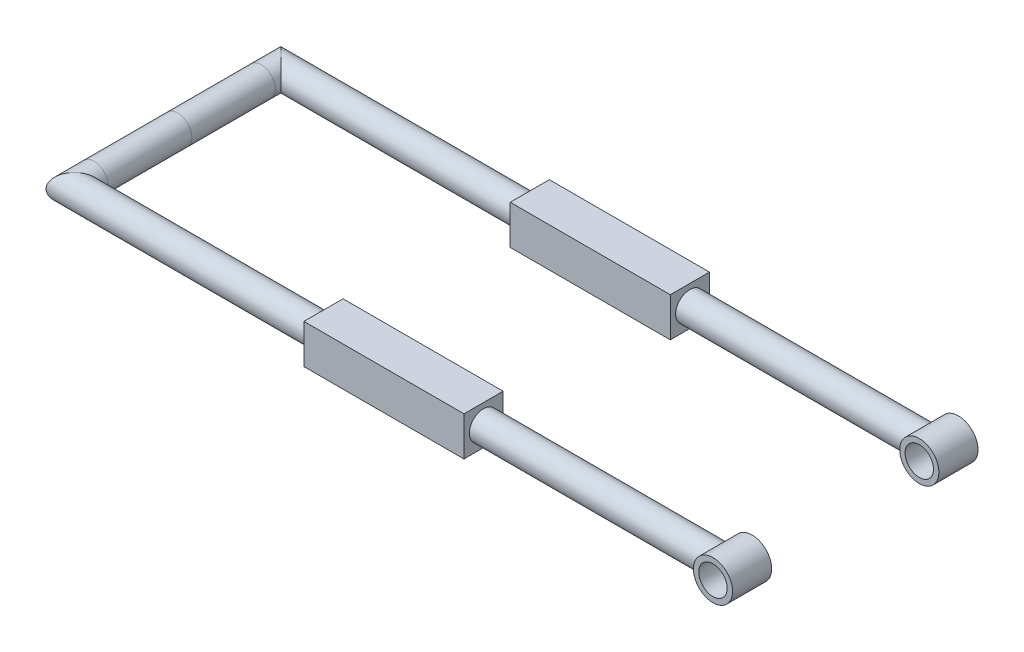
ISO-10303-21;
HEADER;
FILE_DESCRIPTION(('STEP AP214'),'2;1');
FILE_NAME('part.step','',(''),(''),'','','');
FILE_SCHEMA(('AUTOMOTIVE_DESIGN { 1 0 10303 214 1 1 1 1 }'));
ENDSEC;
DATA;
#1=APPLICATION_CONTEXT('core data for automotive mechanical design processes');
#2=APPLICATION_PROTOCOL_DEFINITION('international standard','automotive_design',2000,#1);
#3=PRODUCT_CONTEXT('',#1,'mechanical');
#4=PRODUCT('Part','Part','',(#3));
#5=PRODUCT_RELATED_PRODUCT_CATEGORY('part','',(#4));
#6=PRODUCT_DEFINITION_FORMATION('','',#4);
#7=PRODUCT_DEFINITION_CONTEXT('part definition',#1,'design');
#8=PRODUCT_DEFINITION('design','',#6,#7);
#9=PRODUCT_DEFINITION_SHAPE('','',#8);
#10=(LENGTH_UNIT() NAMED_UNIT(*) SI_UNIT(.MILLI.,.METRE.));
#11=(NAMED_UNIT(*) PLANE_ANGLE_UNIT() SI_UNIT($,.RADIAN.));
#12=(NAMED_UNIT(*) SI_UNIT($,.STERADIAN.) SOLID_ANGLE_UNIT());
#13=UNCERTAINTY_MEASURE_WITH_UNIT(LENGTH_MEASURE(1.E-05),#10,'distance_accuracy_value','');
#14=(GEOMETRIC_REPRESENTATION_CONTEXT(3) GLOBAL_UNCERTAINTY_ASSIGNED_CONTEXT((#13)) GLOBAL_UNIT_ASSIGNED_CONTEXT((#10,
#11,#12)) REPRESENTATION_CONTEXT('',''));
#15=CARTESIAN_POINT('',(0.,0.,0.));
#16=DIRECTION('',(0.,0.,1.));
#17=DIRECTION('',(1.,0.,0.));
#18=AXIS2_PLACEMENT_3D('',#15,#16,#17);
#19=CARTESIAN_POINT('',(939.8,0.,-175.26));
#20=DIRECTION('',(0.,0.,1.));
#21=DIRECTION('',(1.,0.,0.));
#22=AXIS2_PLACEMENT_3D('',#19,#20,#21);
#23=CYLINDRICAL_SURFACE('',#22,27.9399999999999);
#24=CARTESIAN_POINT('',(911.86,0.,-167.64));
#25=CARTESIAN_POINT('',(911.860004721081,0.499914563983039,-167.639995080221));
#26=CARTESIAN_POINT('',(911.87345068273,0.999977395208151,-167.621517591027));
#27=CARTESIAN_POINT('',(911.926931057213,1.99618720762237,-167.547886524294));
#28=CARTESIAN_POINT('',(911.966982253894,2.49233151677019,-167.492709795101));
#29=CARTESIAN_POINT('',(912.072839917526,3.47768027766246,-167.346401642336));
#30=CARTESIAN_POINT('',(912.13870558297,3.96686608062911,-167.255187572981));
#31=CARTESIAN_POINT('',(912.294650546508,4.93345998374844,-167.038233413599));
#32=CARTESIAN_POINT('',(912.384726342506,5.41086977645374,-166.912498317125));
#33=CARTESIAN_POINT('',(912.586522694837,6.34812576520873,-166.629116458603));
#34=CARTESIAN_POINT('',(912.698110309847,6.80806006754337,-166.471665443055));
#35=CARTESIAN_POINT('',(912.941040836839,7.71093407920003,-166.126316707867));
#36=CARTESIAN_POINT('',(913.072384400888,8.1538732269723,-165.938417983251));
#37=CARTESIAN_POINT('',(913.35232108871,9.02059776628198,-165.53427328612));
#38=CARTESIAN_POINT('',(913.500904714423,9.44439352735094,-165.318042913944));
#39=CARTESIAN_POINT('',(913.81286539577,10.2717055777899,-164.859050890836));
#40=CARTESIAN_POINT('',(913.976244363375,10.675219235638,-164.616285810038));
#41=CARTESIAN_POINT('',(914.33060346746,11.4965747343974,-164.082824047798));
#42=CARTESIAN_POINT('',(914.522742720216,11.9123887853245,-163.789776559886));
#43=CARTESIAN_POINT('',(914.918141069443,12.7176226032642,-163.176252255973));
#44=CARTESIAN_POINT('',(915.121400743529,13.1070409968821,-162.855774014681));
#45=CARTESIAN_POINT('',(915.535886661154,13.8593322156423,-162.188572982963));
#46=CARTESIAN_POINT('',(915.747124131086,14.222165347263,-161.841812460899));
#47=CARTESIAN_POINT('',(916.173702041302,14.9200854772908,-161.123773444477));
#48=CARTESIAN_POINT('',(916.389042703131,15.2551709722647,-160.752493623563));
#49=CARTESIAN_POINT('',(916.861261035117,15.9583752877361,-159.913133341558));
#50=CARTESIAN_POINT('',(917.118213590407,16.3205725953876,-159.44011175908));
#51=CARTESIAN_POINT('',(917.625648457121,17.0036121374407,-158.461623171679));
#52=CARTESIAN_POINT('',(917.876128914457,17.3244426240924,-157.956147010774));
#53=CARTESIAN_POINT('',(918.362336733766,17.9225677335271,-156.913975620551));
#54=CARTESIAN_POINT('',(918.598080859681,18.1999123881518,-156.377317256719));
#55=CARTESIAN_POINT('',(918.933696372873,18.5814355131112,-155.549513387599));
#56=CARTESIAN_POINT('',(919.042549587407,18.70284160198,-155.269830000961));
#57=CARTESIAN_POINT('',(919.253021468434,18.9338233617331,-154.7028491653));
#58=CARTESIAN_POINT('',(919.354638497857,19.043396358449,-154.415550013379));
#59=CARTESIAN_POINT('',(919.58237431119,19.2854206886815,-153.734536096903));
#60=CARTESIAN_POINT('',(919.705054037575,19.4129577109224,-153.337897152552));
#61=CARTESIAN_POINT('',(919.931353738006,19.6445088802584,-152.532592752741));
#62=CARTESIAN_POINT('',(920.034979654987,19.7485303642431,-152.123931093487));
#63=CARTESIAN_POINT('',(920.219556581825,19.9315513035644,-151.29677045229));
#64=CARTESIAN_POINT('',(920.300548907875,20.0105963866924,-150.878290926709));
#65=CARTESIAN_POINT('',(920.436940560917,20.1426061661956,-150.033066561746));
#66=CARTESIAN_POINT('',(920.492339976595,20.1955709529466,-149.606321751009));
#67=CARTESIAN_POINT('',(920.575411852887,20.2746681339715,-148.74438679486));
#68=CARTESIAN_POINT('',(920.60287437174,20.3005973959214,-148.309157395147));
#69=CARTESIAN_POINT('',(920.628016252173,20.3243437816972,-147.437076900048));
#70=CARTESIAN_POINT('',(920.625696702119,20.3221619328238,-147.000225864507));
#71=CARTESIAN_POINT('',(920.591379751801,20.2897277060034,-146.128476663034));
#72=CARTESIAN_POINT('',(920.559363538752,20.2594575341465,-145.693579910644));
#73=CARTESIAN_POINT('',(920.46716098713,20.1714884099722,-144.82959970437));
#74=CARTESIAN_POINT('',(920.406971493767,20.1137863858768,-144.40051690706));
#75=CARTESIAN_POINT('',(920.252654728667,19.9639109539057,-143.502255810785));
#76=CARTESIAN_POINT('',(920.15541786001,19.8685335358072,-143.034149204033));
#77=CARTESIAN_POINT('',(919.933829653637,19.6469677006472,-142.111917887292));
#78=CARTESIAN_POINT('',(919.809474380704,19.520774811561,-141.657795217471));
#79=CARTESIAN_POINT('',(919.538386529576,19.2392522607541,-140.764598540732));
#80=CARTESIAN_POINT('',(919.39161155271,19.0838672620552,-140.325555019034));
#81=CARTESIAN_POINT('',(919.080709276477,18.7458618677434,-139.464488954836));
#82=CARTESIAN_POINT('',(918.916580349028,18.5632389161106,-139.042468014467));
#83=CARTESIAN_POINT('',(918.517965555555,18.1063184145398,-138.076775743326));
#84=CARTESIAN_POINT('',(918.278398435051,17.8218583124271,-137.539992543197));
#85=CARTESIAN_POINT('',(917.785552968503,17.2093687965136,-136.498485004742));
#86=CARTESIAN_POINT('',(917.532270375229,16.8813258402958,-135.993770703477));
#87=CARTESIAN_POINT('',(917.019798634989,16.1831311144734,-135.016771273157));
#88=CARTESIAN_POINT('',(916.760604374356,15.8129416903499,-134.544515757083));
#89=CARTESIAN_POINT('',(916.243614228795,15.0319534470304,-133.63415313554));
#90=CARTESIAN_POINT('',(915.985818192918,14.6211591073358,-133.196042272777));
#91=CARTESIAN_POINT('',(915.474788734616,13.7544162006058,-132.350377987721));
#92=CARTESIAN_POINT('',(915.221654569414,13.2979612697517,-131.94328230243));
#93=CARTESIAN_POINT('',(914.729670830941,12.3454298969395,-131.168538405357));
#94=CARTESIAN_POINT('',(914.49082275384,11.8493493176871,-130.800894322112));
#95=CARTESIAN_POINT('',(914.033993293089,10.820012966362,-130.109154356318));
#96=CARTESIAN_POINT('',(913.815972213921,10.2868314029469,-129.784975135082));
#97=CARTESIAN_POINT('',(913.508857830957,9.46075321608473,-129.334033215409));
#98=CARTESIAN_POINT('',(913.409814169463,9.18103666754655,-129.189618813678));
#99=CARTESIAN_POINT('',(913.219026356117,8.61308213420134,-128.913017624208));
#100=CARTESIAN_POINT('',(913.127284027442,8.32484204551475,-128.780833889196));
#101=CARTESIAN_POINT('',(912.909141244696,7.59809282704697,-128.468075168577));
#102=CARTESIAN_POINT('',(912.787607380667,7.15473247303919,-128.295263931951));
#103=CARTESIAN_POINT('',(912.564634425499,6.25254655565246,-127.979980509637));
#104=CARTESIAN_POINT('',(912.463190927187,5.7937244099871,-127.837501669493));
#105=CARTESIAN_POINT('',(912.282430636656,4.8632717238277,-127.584670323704));
#106=CARTESIAN_POINT('',(912.203102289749,4.39164801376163,-127.474301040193));
#107=CARTESIAN_POINT('',(912.068200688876,3.43840217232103,-127.287134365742));
#108=CARTESIAN_POINT('',(912.012628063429,2.95677977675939,-127.210337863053));
#109=CARTESIAN_POINT('',(911.926336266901,1.98523511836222,-127.091267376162));
#110=CARTESIAN_POINT('',(911.895709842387,1.49528873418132,-127.049122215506));
#111=CARTESIAN_POINT('',(911.860378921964,0.51268982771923,-127.000514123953));
#112=CARTESIAN_POINT('',(911.855674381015,0.0200373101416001,-126.994051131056));
#113=CARTESIAN_POINT('',(911.872299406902,-0.964011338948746,-127.01691352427));
#114=CARTESIAN_POINT('',(911.893630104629,-1.45540741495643,-127.046240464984));
#115=CARTESIAN_POINT('',(911.961821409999,-2.43300024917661,-127.140207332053));
#116=CARTESIAN_POINT('',(912.008681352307,-2.91919714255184,-127.204846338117));
#117=CARTESIAN_POINT('',(912.123505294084,-3.85552230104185,-127.363798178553));
#118=CARTESIAN_POINT('',(912.190128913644,-4.30613751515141,-127.456230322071));
#119=CARTESIAN_POINT('',(912.343822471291,-5.19674046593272,-127.67041864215));
#120=CARTESIAN_POINT('',(912.430891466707,-5.63672869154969,-127.792173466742));
#121=CARTESIAN_POINT('',(912.623877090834,-6.50378723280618,-128.063583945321));
#122=CARTESIAN_POINT('',(912.729795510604,-6.93085631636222,-128.213242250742));
#123=CARTESIAN_POINT('',(912.958650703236,-7.77012216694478,-128.538885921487));
#124=CARTESIAN_POINT('',(913.081588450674,-8.18231808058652,-128.714872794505));
#125=CARTESIAN_POINT('',(913.353405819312,-9.0240126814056,-129.107289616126));
#126=CARTESIAN_POINT('',(913.503594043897,-9.45208592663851,-129.325868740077));
#127=CARTESIAN_POINT('',(913.819031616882,-10.2874817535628,-129.790068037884));
#128=CARTESIAN_POINT('',(913.984281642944,-10.6948034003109,-130.035689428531));
#129=CARTESIAN_POINT('',(914.327258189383,-11.4878081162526,-130.552271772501));
#130=CARTESIAN_POINT('',(914.504990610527,-11.8734807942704,-130.823244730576));
#131=CARTESIAN_POINT('',(914.870173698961,-12.6222388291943,-131.388845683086));
#132=CARTESIAN_POINT('',(915.057625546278,-12.9853214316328,-131.683476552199));
#133=CARTESIAN_POINT('',(915.474420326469,-13.7525843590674,-132.350947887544));
#134=CARTESIAN_POINT('',(915.705156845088,-14.1521437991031,-132.728239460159));
#135=CARTESIAN_POINT('',(916.171726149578,-14.9180901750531,-133.512269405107));
#136=CARTESIAN_POINT('',(916.407559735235,-15.284471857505,-133.919012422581));
#137=CARTESIAN_POINT('',(916.879521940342,-15.9835308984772,-134.760987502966));
#138=CARTESIAN_POINT('',(917.115650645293,-16.3161812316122,-135.196241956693));
#139=CARTESIAN_POINT('',(917.582545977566,-16.9464472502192,-136.094086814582));
#140=CARTESIAN_POINT('',(917.813313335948,-17.2440677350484,-136.556673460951));
#141=CARTESIAN_POINT('',(918.236255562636,-17.7693040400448,-137.451365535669));
#142=CARTESIAN_POINT('',(918.429732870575,-18.0010341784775,-137.880440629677));
#143=CARTESIAN_POINT('',(918.803021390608,-18.4350864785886,-138.75903961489));
#144=CARTESIAN_POINT('',(918.982832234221,-18.6374078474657,-139.208564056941));
#145=CARTESIAN_POINT('',(919.323083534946,-19.0106068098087,-140.126646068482));
#146=CARTESIAN_POINT('',(919.483556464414,-19.1815373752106,-140.595169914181));
#147=CARTESIAN_POINT('',(919.779509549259,-19.4902373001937,-141.550693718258));
#148=CARTESIAN_POINT('',(919.914997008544,-19.6280163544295,-142.037688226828));
#149=CARTESIAN_POINT('',(920.128986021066,-19.8421907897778,-142.921177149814));
#150=CARTESIAN_POINT('',(920.213476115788,-19.9254156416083,-143.314571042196));
#151=CARTESIAN_POINT('',(920.360467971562,-20.0688509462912,-144.109596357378));
#152=CARTESIAN_POINT('',(920.422972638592,-20.129064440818,-144.511226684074));
#153=CARTESIAN_POINT('',(920.523568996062,-20.2254217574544,-145.319922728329));
#154=CARTESIAN_POINT('',(920.561690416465,-20.2615948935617,-145.726981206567));
#155=CARTESIAN_POINT('',(920.612064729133,-20.3093073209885,-146.544159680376));
#156=CARTESIAN_POINT('',(920.62431746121,-20.3208464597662,-146.954279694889));
#157=CARTESIAN_POINT('',(920.622419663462,-20.3190554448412,-147.775015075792));
#158=CARTESIAN_POINT('',(920.608229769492,-20.3056882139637,-148.185630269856));
#159=CARTESIAN_POINT('',(920.553986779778,-20.2542822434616,-149.003564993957));
#160=CARTESIAN_POINT('',(920.513933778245,-20.2162435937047,-149.410884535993));
#161=CARTESIAN_POINT('',(920.409546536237,-20.1161407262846,-150.219944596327));
#162=CARTESIAN_POINT('',(920.345179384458,-20.0540439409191,-150.621676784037));
#163=CARTESIAN_POINT('',(920.194595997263,-19.9068526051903,-151.41672488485));
#164=CARTESIAN_POINT('',(920.108376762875,-19.8217548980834,-151.810039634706));
#165=CARTESIAN_POINT('',(919.887755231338,-19.6004436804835,-152.704912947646));
#166=CARTESIAN_POINT('',(919.746676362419,-19.4565558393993,-153.202936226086));
#167=CARTESIAN_POINT('',(919.438812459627,-19.1341384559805,-154.179430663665));
#168=CARTESIAN_POINT('',(919.272018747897,-18.9555972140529,-154.657895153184));
#169=CARTESIAN_POINT('',(918.918881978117,-18.5658752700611,-155.594558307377));
#170=CARTESIAN_POINT('',(918.732514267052,-18.3546532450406,-156.052730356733));
#171=CARTESIAN_POINT('',(918.346154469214,-17.9015295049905,-156.94752052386));
#172=CARTESIAN_POINT('',(918.146163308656,-17.6596298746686,-157.384140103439));
#173=CARTESIAN_POINT('',(917.731599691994,-17.138940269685,-158.247985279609));
#174=CARTESIAN_POINT('',(917.516771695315,-16.8592770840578,-158.674560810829));
#175=CARTESIAN_POINT('',(917.08286263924,-16.2698866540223,-159.504090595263));
#176=CARTESIAN_POINT('',(916.863781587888,-15.9601594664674,-159.907044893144));
#177=CARTESIAN_POINT('',(916.42561817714,-15.3112764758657,-160.688819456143));
#178=CARTESIAN_POINT('',(916.206535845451,-14.9721101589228,-161.067631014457));
#179=CARTESIAN_POINT('',(915.772424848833,-14.2650411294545,-161.799989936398));
#180=CARTESIAN_POINT('',(915.557396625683,-13.8971353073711,-162.153534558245));
#181=CARTESIAN_POINT('',(915.089191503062,-13.0499768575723,-162.908088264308));
#182=CARTESIAN_POINT('',(914.837899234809,-12.5639191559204,-163.302677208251));
#183=CARTESIAN_POINT('',(914.353480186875,-11.5513326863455,-164.049159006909));
#184=CARTESIAN_POINT('',(914.120357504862,-11.0247948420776,-164.401042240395));
#185=CARTESIAN_POINT('',(913.679008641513,-9.93394397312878,-165.057643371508));
#186=CARTESIAN_POINT('',(913.470757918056,-9.36966905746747,-165.362407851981));
#187=CARTESIAN_POINT('',(913.085284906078,-8.20625218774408,-165.920416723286));
#188=CARTESIAN_POINT('',(912.908046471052,-7.60712859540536,-166.173687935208));
#189=CARTESIAN_POINT('',(912.635689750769,-6.55363076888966,-166.559841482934));
#190=CARTESIAN_POINT('',(912.531554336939,-6.10657201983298,-166.706474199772));
#191=CARTESIAN_POINT('',(912.344111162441,-5.19925008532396,-166.969252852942));
#192=CARTESIAN_POINT('',(912.260802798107,-4.7389872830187,-167.085399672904));
#193=CARTESIAN_POINT('',(912.116910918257,-3.80931657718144,-167.28539571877));
#194=CARTESIAN_POINT('',(912.056267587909,-3.33993623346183,-167.36932997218));
#195=CARTESIAN_POINT('',(911.958713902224,-2.39418248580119,-167.504107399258));
#196=CARTESIAN_POINT('',(911.921790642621,-1.91781302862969,-167.554968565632));
#197=CARTESIAN_POINT('',(911.884767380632,-1.20038726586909,-167.605934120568));
#198=CARTESIAN_POINT('',(911.875486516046,-0.960614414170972,-167.61870165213));
#199=CARTESIAN_POINT('',(911.86310121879,-0.480572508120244,-167.635736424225));
#200=CARTESIAN_POINT('',(911.859997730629,-0.240303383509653,-167.640002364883));
#201=CARTESIAN_POINT('',(911.86,0.,-167.64));
#202=B_SPLINE_CURVE_WITH_KNOTS('',3,(#24,#25,#26,#27,#28,#29,#30,#31,#32,#33,#34,#35,#36,#37,
#38,#39,#40,#41,#42,#43,#44,#45,#46,#47,#48,#49,#50,#51,#52,#53,#54,#55,#56,#57,#58,#59,#60,#61,
#62,#63,#64,#65,#66,#67,#68,#69,#70,#71,#72,#73,#74,#75,#76,#77,#78,#79,#80,#81,#82,#83,#84,#85,
#86,#87,#88,#89,#90,#91,#92,#93,#94,#95,#96,#97,#98,#99,#100,#101,#102,#103,#104,#105,#106,#107,
#108,#109,#110,#111,#112,#113,#114,#115,#116,#117,#118,#119,#120,#121,#122,#123,#124,#125,#126,
#127,#128,#129,#130,#131,#132,#133,#134,#135,#136,#137,#138,#139,#140,#141,#142,#143,#144,#145,
#146,#147,#148,#149,#150,#151,#152,#153,#154,#155,#156,#157,#158,#159,#160,#161,#162,#163,#164,
#165,#166,#167,#168,#169,#170,#171,#172,#173,#174,#175,#176,#177,#178,#179,#180,#181,#182,#183,
#184,#185,#186,#187,#188,#189,#190,#191,#192,#193,#194,#195,#196,#197,#198,#199,#200,#201),
.UNSPECIFIED.,.T.,.F.,(4,2,2,2,2,2,2,2,2,2,2,2,2,2,2,2,2,2,2,2,2,2,2,2,2,2,2,2,2,2,2,2,2,2,2,2,
2,2,2,2,2,2,2,2,2,2,2,2,2,2,2,2,2,2,2,2,2,2,2,2,2,2,2,2,2,2,2,2,2,2,2,2,2,2,2,2,2,2,2,2,2,2,2,2,
2,2,2,2,4),(0.,1.49948350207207,2.99991384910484,4.50380535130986,6.00747942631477,
7.50214270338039,8.99685532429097,10.490748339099,11.984834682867,13.6146338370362,
15.2445177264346,16.8767875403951,18.5091457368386,20.4533981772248,22.3982015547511,
24.3407506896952,25.311665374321,26.2827990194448,27.5846123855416,28.8860190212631,
30.1850342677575,31.4840450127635,32.792747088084,34.1014013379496,35.4108851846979,
36.7205157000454,38.1809335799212,39.6415635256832,41.1049907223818,42.5685553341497,
44.5249437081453,46.4819414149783,48.4407014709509,50.3992456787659,52.3826161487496,
54.3661939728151,56.3459124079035,57.3355881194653,58.325510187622,59.797282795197,
61.2687321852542,62.7394113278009,64.2101293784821,65.6862907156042,67.1624494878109,
68.6386723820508,70.1148568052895,71.5077256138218,72.9005302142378,74.2934672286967,
75.6864840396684,77.1957174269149,78.7050187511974,80.2150384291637,81.7252418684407,
83.5115243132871,85.2980891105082,87.086074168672,88.8738139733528,90.4464305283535,
92.0190894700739,93.5890696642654,95.1585901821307,96.3900480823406,97.6213431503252,
98.8511340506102,100.080932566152,101.312563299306,102.544189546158,103.777488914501,
105.01095763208,106.620273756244,108.230134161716,109.842047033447,111.453850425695,
113.112879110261,114.771904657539,116.431525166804,118.091325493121,120.112425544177,
122.133980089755,124.153523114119,126.172011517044,127.616204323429,129.060355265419,
130.500667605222,131.940195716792,132.660870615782,133.381655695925),.UNSPECIFIED.);
#203=CARTESIAN_POINT('',(911.86,0.,-167.64));
#204=VERTEX_POINT('',#203);
#205=EDGE_CURVE('E49',#204,#204,#202,.T.);
#206=ORIENTED_EDGE('',*,*,#205,.T.);
#207=EDGE_LOOP('',(#206));
#208=FACE_BOUND('',#207,.T.);
#209=CARTESIAN_POINT('',(939.8,0.,-175.26));
#210=DIRECTION('',(0.,0.,1.));
#211=DIRECTION('',(1.,0.,0.));
#212=AXIS2_PLACEMENT_3D('',#209,#210,#211);
#213=CIRCLE('',#212,27.9399999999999);
#214=CARTESIAN_POINT('',(967.74,0.,-175.26));
#215=VERTEX_POINT('',#214);
#216=EDGE_CURVE('E331',#215,#215,#213,.T.);
#217=ORIENTED_EDGE('',*,*,#216,.T.);
#218=EDGE_LOOP('',(#217));
#219=FACE_BOUND('',#218,.T.);
#220=CARTESIAN_POINT('',(939.8,0.,-119.38));
#221=DIRECTION('',(0.,0.,1.));
#222=DIRECTION('',(1.,0.,0.));
#223=AXIS2_PLACEMENT_3D('',#220,#221,#222);
#224=CIRCLE('',#223,27.9399999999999);
#225=CARTESIAN_POINT('',(967.74,0.,-119.38));
#226=VERTEX_POINT('',#225);
#227=EDGE_CURVE('E334',#226,#226,#224,.T.);
#228=ORIENTED_EDGE('',*,*,#227,.F.);
#229=EDGE_LOOP('',(#228));
#230=FACE_BOUND('',#229,.T.);
#231=ADVANCED_FACE('F39',(#208,#219,#230),#23,.T.);
#232=CARTESIAN_POINT('',(939.8,0.,-175.26));
#233=DIRECTION('',(0.,0.,1.));
#234=DIRECTION('',(1.,0.,0.));
#235=AXIS2_PLACEMENT_3D('',#232,#233,#234);
#236=CYLINDRICAL_SURFACE('',#235,20.32);
#237=CARTESIAN_POINT('',(939.8,0.,-175.26));
#238=DIRECTION('',(0.,0.,1.));
#239=DIRECTION('',(1.,0.,0.));
#240=AXIS2_PLACEMENT_3D('',#237,#238,#239);
#241=CIRCLE('',#240,20.32);
#242=CARTESIAN_POINT('',(960.12,0.,-175.26));
#243=VERTEX_POINT('',#242);
#244=EDGE_CURVE('E345',#243,#243,#241,.T.);
#245=ORIENTED_EDGE('',*,*,#244,.F.);
#246=EDGE_LOOP('',(#245));
#247=FACE_BOUND('',#246,.T.);
#248=CARTESIAN_POINT('',(939.8,0.,-119.38));
#249=DIRECTION('',(0.,0.,1.));
#250=DIRECTION('',(1.,0.,0.));
#251=AXIS2_PLACEMENT_3D('',#248,#249,#250);
#252=CIRCLE('',#251,20.32);
#253=CARTESIAN_POINT('',(960.12,0.,-119.38));
#254=VERTEX_POINT('',#253);
#255=EDGE_CURVE('E43',#254,#254,#252,.F.);
#256=ORIENTED_EDGE('',*,*,#255,.F.);
#257=EDGE_LOOP('',(#256));
#258=FACE_BOUND('',#257,.T.);
#259=ADVANCED_FACE('F301',(#247,#258),#236,.F.);
#260=CARTESIAN_POINT('',(-22.452,0.,147.32));
#261=DIRECTION('',(1.,0.,0.));
#262=DIRECTION('',(0.,0.,-1.));
#263=AXIS2_PLACEMENT_3D('',#260,#261,#262);
#264=CYLINDRICAL_SURFACE('',#263,20.32);
#265=CARTESIAN_POINT('',(0.,0.,147.32));
#266=DIRECTION('',(0.707106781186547,0.,0.707106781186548));
#267=DIRECTION('',(-0.707106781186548,0.,0.707106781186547));
#268=AXIS2_PLACEMENT_3D('',#265,#266,#267);
#269=ELLIPSE('',#268,28.7368195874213,20.32);
#270=CARTESIAN_POINT('',(-20.32,0.,167.64));
#271=VERTEX_POINT('',#270);
#272=EDGE_CURVE('E208',#271,#271,#269,.F.);
#273=ORIENTED_EDGE('',*,*,#272,.F.);
#274=EDGE_LOOP('',(#273));
#275=FACE_BOUND('',#274,.T.);
#276=CARTESIAN_POINT('',(355.6,0.,147.32));
#277=DIRECTION('',(1.,0.,0.));
#278=DIRECTION('',(0.,0.,-1.));
#279=AXIS2_PLACEMENT_3D('',#276,#277,#278);
#280=CIRCLE('',#279,20.32);
#281=CARTESIAN_POINT('',(355.6,0.,127.));
#282=VERTEX_POINT('',#281);
#283=EDGE_CURVE('E196',#282,#282,#280,.T.);
#284=ORIENTED_EDGE('',*,*,#283,.F.);
#285=EDGE_LOOP('',(#284));
#286=FACE_BOUND('',#285,.T.);
#287=ADVANCED_FACE('F41',(#275,#286),#264,.T.);
#288=CARTESIAN_POINT('',(0.,0.,-169.772));
#289=DIRECTION('',(0.,0.,1.));
#290=DIRECTION('',(1.,0.,0.));
#291=AXIS2_PLACEMENT_3D('',#288,#289,#290);
#292=CYLINDRICAL_SURFACE('',#291,20.32);
#293=CARTESIAN_POINT('',(0.,0.,-147.32));
#294=DIRECTION('',(-0.707106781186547,0.,0.707106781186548));
#295=DIRECTION('',(-0.707106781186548,0.,-0.707106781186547));
#296=AXIS2_PLACEMENT_3D('',#293,#294,#295);
#297=ELLIPSE('',#296,28.7368195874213,20.32);
#298=CARTESIAN_POINT('',(-20.3200000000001,0.,-167.64));
#299=VERTEX_POINT('',#298);
#300=EDGE_CURVE('E197',#299,#299,#297,.F.);
#301=ORIENTED_EDGE('',*,*,#300,.F.);
#302=EDGE_LOOP('',(#301));
#303=FACE_BOUND('',#302,.T.);
#304=CARTESIAN_POINT('',(0.,0.,-119.38));
#305=DIRECTION('',(0.,0.,1.));
#306=DIRECTION('',(1.,0.,0.));
#307=AXIS2_PLACEMENT_3D('',#304,#305,#306);
#308=CIRCLE('',#307,20.32);
#309=CARTESIAN_POINT('',(20.32,0.,-119.38));
#310=VERTEX_POINT('',#309);
#311=EDGE_CURVE('E203',#310,#310,#308,.T.);
#312=ORIENTED_EDGE('',*,*,#311,.F.);
#313=EDGE_LOOP('',(#312));
#314=FACE_BOUND('',#313,.T.);
#315=ADVANCED_FACE('F302',(#303,#314),#292,.T.);
#316=CARTESIAN_POINT('',(0.,0.,-119.38));
#317=DIRECTION('',(0.,0.,1.));
#318=DIRECTION('',(1.,0.,0.));
#319=AXIS2_PLACEMENT_3D('',#316,#317,#318);
#320=CYLINDRICAL_SURFACE('',#319,20.32);
#321=CARTESIAN_POINT('',(0.,0.,0.));
#322=DIRECTION('',(0.,0.,1.));
#323=DIRECTION('',(1.,0.,0.));
#324=AXIS2_PLACEMENT_3D('',#321,#322,#323);
#325=CIRCLE('',#324,20.32);
#326=CARTESIAN_POINT('',(20.32,0.,0.));
#327=VERTEX_POINT('',#326);
#328=EDGE_CURVE('E207',#327,#327,#325,.T.);
#329=ORIENTED_EDGE('',*,*,#328,.F.);
#330=EDGE_LOOP('',(#329));
#331=FACE_BOUND('',#330,.T.);
#332=ORIENTED_EDGE('',*,*,#311,.T.);
#333=EDGE_LOOP('',(#332));
#334=FACE_BOUND('',#333,.T.);
#335=ADVANCED_FACE('F305',(#331,#334),#320,.T.);
#336=CARTESIAN_POINT('',(0.,0.,0.));
#337=DIRECTION('',(0.,0.,1.));
#338=DIRECTION('',(1.,0.,0.));
#339=AXIS2_PLACEMENT_3D('',#336,#337,#338);
#340=CYLINDRICAL_SURFACE('',#339,20.32);
#341=CARTESIAN_POINT('',(0.,0.,119.38));
#342=DIRECTION('',(0.,0.,1.));
#343=DIRECTION('',(1.,0.,0.));
#344=AXIS2_PLACEMENT_3D('',#341,#342,#343);
#345=CIRCLE('',#344,20.32);
#346=CARTESIAN_POINT('',(20.32,0.,119.38));
#347=VERTEX_POINT('',#346);
#348=EDGE_CURVE('E202',#347,#347,#345,.T.);
#349=ORIENTED_EDGE('',*,*,#348,.F.);
#350=EDGE_LOOP('',(#349));
#351=FACE_BOUND('',#350,.T.);
#352=ORIENTED_EDGE('',*,*,#328,.T.);
#353=EDGE_LOOP('',(#352));
#354=FACE_BOUND('',#353,.T.);
#355=ADVANCED_FACE('F309',(#351,#354),#340,.T.);
#356=CARTESIAN_POINT('',(0.,0.,119.38));
#357=DIRECTION('',(0.,0.,1.));
#358=DIRECTION('',(1.,0.,0.));
#359=AXIS2_PLACEMENT_3D('',#356,#357,#358);
#360=CYLINDRICAL_SURFACE('',#359,20.32);
#361=ORIENTED_EDGE('',*,*,#348,.T.);
#362=EDGE_LOOP('',(#361));
#363=FACE_BOUND('',#362,.T.);
#364=ORIENTED_EDGE('',*,*,#272,.T.);
#365=EDGE_LOOP('',(#364));
#366=FACE_BOUND('',#365,.T.);
#367=ADVANCED_FACE('F299',(#363,#366),#360,.T.);
#368=CARTESIAN_POINT('',(355.6,0.,-147.32));
#369=DIRECTION('',(-1.,0.,0.));
#370=DIRECTION('',(0.,0.,1.));
#371=AXIS2_PLACEMENT_3D('',#368,#369,#370);
#372=CYLINDRICAL_SURFACE('',#371,20.32);
#373=CARTESIAN_POINT('',(355.6,0.,-147.32));
#374=DIRECTION('',(-1.,0.,0.));
#375=DIRECTION('',(0.,0.,1.));
#376=AXIS2_PLACEMENT_3D('',#373,#374,#375);
#377=CIRCLE('',#376,20.32);
#378=CARTESIAN_POINT('',(355.6,0.,-127.));
#379=VERTEX_POINT('',#378);
#380=EDGE_CURVE('E192',#379,#379,#377,.T.);
#381=ORIENTED_EDGE('',*,*,#380,.T.);
#382=EDGE_LOOP('',(#381));
#383=FACE_BOUND('',#382,.T.);
#384=ORIENTED_EDGE('',*,*,#300,.T.);
#385=EDGE_LOOP('',(#384));
#386=FACE_BOUND('',#385,.T.);
#387=ADVANCED_FACE('F295',(#383,#386),#372,.T.);
#388=CARTESIAN_POINT('',(584.2,-27.94,-175.26));
#389=DIRECTION('',(-1.,0.,0.));
#390=DIRECTION('',(0.,0.,1.));
#391=AXIS2_PLACEMENT_3D('',#388,#389,#390);
#392=PLANE('',#391);
#393=CARTESIAN_POINT('',(584.2,0.,-147.32));
#394=DIRECTION('',(-1.,0.,0.));
#395=DIRECTION('',(0.,0.,1.));
#396=AXIS2_PLACEMENT_3D('',#393,#394,#395);
#397=CIRCLE('',#396,20.32);
#398=CARTESIAN_POINT('',(584.2,0.,-127.));
#399=VERTEX_POINT('',#398);
#400=EDGE_CURVE('E201',#399,#399,#397,.F.);
#401=ORIENTED_EDGE('',*,*,#400,.F.);
#402=EDGE_LOOP('',(#401));
#403=FACE_BOUND('',#402,.T.);
#404=DIRECTION('',(0.,1.,0.));
#405=VECTOR('',#404,1.);
#406=CARTESIAN_POINT('',(584.2,-27.94,-175.26));
#407=LINE('',#406,#405);
#408=CARTESIAN_POINT('',(584.2,-27.94,-175.26));
#409=VERTEX_POINT('',#408);
#410=CARTESIAN_POINT('',(584.2,27.94,-175.26));
#411=VERTEX_POINT('',#410);
#412=EDGE_CURVE('E180',#409,#411,#407,.T.);
#413=ORIENTED_EDGE('',*,*,#412,.T.);
#414=DIRECTION('',(0.,0.,1.));
#415=VECTOR('',#414,1.);
#416=CARTESIAN_POINT('',(584.2,27.94,-175.26));
#417=LINE('',#416,#415);
#418=CARTESIAN_POINT('',(584.2,27.94,-119.38));
#419=VERTEX_POINT('',#418);
#420=EDGE_CURVE('E154',#411,#419,#417,.T.);
#421=ORIENTED_EDGE('',*,*,#420,.T.);
#422=DIRECTION('',(0.,1.,0.));
#423=VECTOR('',#422,1.);
#424=CARTESIAN_POINT('',(584.2,-27.94,-119.38));
#425=LINE('',#424,#423);
#426=CARTESIAN_POINT('',(584.2,-27.94,-119.38));
#427=VERTEX_POINT('',#426);
#428=EDGE_CURVE('E189',#427,#419,#425,.T.);
#429=ORIENTED_EDGE('',*,*,#428,.F.);
#430=DIRECTION('',(0.,0.,1.));
#431=VECTOR('',#430,1.);
#432=CARTESIAN_POINT('',(584.2,-27.94,-175.26));
#433=LINE('',#432,#431);
#434=EDGE_CURVE('E170',#409,#427,#433,.T.);
#435=ORIENTED_EDGE('',*,*,#434,.F.);
#436=EDGE_LOOP('',(#413,#421,#429,#435));
#437=FACE_BOUND('',#436,.T.);
#438=ADVANCED_FACE('F291',(#403,#437),#392,.F.);
#439=CARTESIAN_POINT('',(584.2,-27.94,-119.38));
#440=DIRECTION('',(0.,0.,-1.));
#441=DIRECTION('',(-1.,0.,0.));
#442=AXIS2_PLACEMENT_3D('',#439,#440,#441);
#443=PLANE('',#442);
#444=ORIENTED_EDGE('',*,*,#428,.T.);
#445=DIRECTION('',(-1.,0.,0.));
#446=VECTOR('',#445,1.);
#447=CARTESIAN_POINT('',(584.2,27.94,-119.38));
#448=LINE('',#447,#446);
#449=CARTESIAN_POINT('',(355.6,27.94,-119.38));
#450=VERTEX_POINT('',#449);
#451=EDGE_CURVE('E158',#419,#450,#448,.T.);
#452=ORIENTED_EDGE('',*,*,#451,.T.);
#453=DIRECTION('',(0.,1.,0.));
#454=VECTOR('',#453,1.);
#455=CARTESIAN_POINT('',(355.6,-27.94,-119.38));
#456=LINE('',#455,#454);
#457=CARTESIAN_POINT('',(355.6,-27.94,-119.38));
#458=VERTEX_POINT('',#457);
#459=EDGE_CURVE('E186',#458,#450,#456,.T.);
#460=ORIENTED_EDGE('',*,*,#459,.F.);
#461=DIRECTION('',(-1.,0.,0.));
#462=VECTOR('',#461,1.);
#463=CARTESIAN_POINT('',(584.2,-27.94,-119.38));
#464=LINE('',#463,#462);
#465=EDGE_CURVE('E173',#427,#458,#464,.T.);
#466=ORIENTED_EDGE('',*,*,#465,.F.);
#467=EDGE_LOOP('',(#444,#452,#460,#466));
#468=FACE_BOUND('',#467,.T.);
#469=ADVANCED_FACE('F287',(#468),#443,.F.);
#470=CARTESIAN_POINT('',(355.6,-27.94,-147.32));
#471=DIRECTION('',(1.,0.,0.));
#472=DIRECTION('',(0.,0.,-1.));
#473=AXIS2_PLACEMENT_3D('',#470,#471,#472);
#474=PLANE('',#473);
#475=ORIENTED_EDGE('',*,*,#380,.F.);
#476=EDGE_LOOP('',(#475));
#477=FACE_BOUND('',#476,.T.);
#478=ORIENTED_EDGE('',*,*,#459,.T.);
#479=DIRECTION('',(0.,0.,1.));
#480=VECTOR('',#479,1.);
#481=CARTESIAN_POINT('',(355.6,27.94,-147.32));
#482=LINE('',#481,#480);
#483=CARTESIAN_POINT('',(355.6,27.94,-175.26));
#484=VERTEX_POINT('',#483);
#485=EDGE_CURVE('E162',#484,#450,#482,.T.);
#486=ORIENTED_EDGE('',*,*,#485,.F.);
#487=DIRECTION('',(0.,1.,0.));
#488=VECTOR('',#487,1.);
#489=CARTESIAN_POINT('',(355.6,-27.94,-175.26));
#490=LINE('',#489,#488);
#491=CARTESIAN_POINT('',(355.6,-27.94,-175.26));
#492=VERTEX_POINT('',#491);
#493=EDGE_CURVE('E183',#492,#484,#490,.T.);
#494=ORIENTED_EDGE('',*,*,#493,.F.);
#495=DIRECTION('',(0.,0.,1.));
#496=VECTOR('',#495,1.);
#497=CARTESIAN_POINT('',(355.6,-27.94,-147.32));
#498=LINE('',#497,#496);
#499=EDGE_CURVE('E62',#492,#458,#498,.T.);
#500=ORIENTED_EDGE('',*,*,#499,.T.);
#501=EDGE_LOOP('',(#478,#486,#494,#500));
#502=FACE_BOUND('',#501,.T.);
#503=ADVANCED_FACE('F283',(#477,#502),#474,.F.);
#504=CARTESIAN_POINT('',(355.6,-27.94,-175.26));
#505=DIRECTION('',(0.,0.,1.));
#506=DIRECTION('',(1.,0.,0.));
#507=AXIS2_PLACEMENT_3D('',#504,#505,#506);
#508=PLANE('',#507);
#509=ORIENTED_EDGE('',*,*,#493,.T.);
#510=DIRECTION('',(1.,0.,0.));
#511=VECTOR('',#510,1.);
#512=CARTESIAN_POINT('',(355.6,27.94,-175.26));
#513=LINE('',#512,#511);
#514=EDGE_CURVE('E166',#484,#411,#513,.T.);
#515=ORIENTED_EDGE('',*,*,#514,.T.);
#516=ORIENTED_EDGE('',*,*,#412,.F.);
#517=DIRECTION('',(1.,0.,0.));
#518=VECTOR('',#517,1.);
#519=CARTESIAN_POINT('',(355.6,-27.94,-175.26));
#520=LINE('',#519,#518);
#521=EDGE_CURVE('E57',#492,#409,#520,.T.);
#522=ORIENTED_EDGE('',*,*,#521,.F.);
#523=EDGE_LOOP('',(#509,#515,#516,#522));
#524=FACE_BOUND('',#523,.T.);
#525=ADVANCED_FACE('F280',(#524),#508,.F.);
#526=CARTESIAN_POINT('',(0.,-27.94,0.));
#527=DIRECTION('',(0.,-1.,0.));
#528=DIRECTION('',(0.,0.,-1.));
#529=AXIS2_PLACEMENT_3D('',#526,#527,#528);
#530=PLANE('',#529);
#531=ORIENTED_EDGE('',*,*,#434,.T.);
#532=ORIENTED_EDGE('',*,*,#465,.T.);
#533=ORIENTED_EDGE('',*,*,#499,.F.);
#534=ORIENTED_EDGE('',*,*,#521,.T.);
#535=EDGE_LOOP('',(#531,#532,#533,#534));
#536=FACE_BOUND('',#535,.T.);
#537=ADVANCED_FACE('F276',(#536),#530,.T.);
#538=CARTESIAN_POINT('',(0.,27.94,0.));
#539=DIRECTION('',(0.,-1.,0.));
#540=DIRECTION('',(0.,0.,-1.));
#541=AXIS2_PLACEMENT_3D('',#538,#539,#540);
#542=PLANE('',#541);
#543=ORIENTED_EDGE('',*,*,#420,.F.);
#544=ORIENTED_EDGE('',*,*,#514,.F.);
#545=ORIENTED_EDGE('',*,*,#485,.T.);
#546=ORIENTED_EDGE('',*,*,#451,.F.);
#547=EDGE_LOOP('',(#543,#544,#545,#546));
#548=FACE_BOUND('',#547,.T.);
#549=ADVANCED_FACE('F257',(#548),#542,.F.);
#550=CARTESIAN_POINT('',(355.6,-27.94,175.26));
#551=DIRECTION('',(0.,0.,1.));
#552=DIRECTION('',(1.,0.,0.));
#553=AXIS2_PLACEMENT_3D('',#550,#551,#552);
#554=PLANE('',#553);
#555=DIRECTION('',(0.,1.,0.));
#556=VECTOR('',#555,1.);
#557=CARTESIAN_POINT('',(584.2,-27.94,175.26));
#558=LINE('',#557,#556);
#559=CARTESIAN_POINT('',(584.2,-27.94,175.26));
#560=VERTEX_POINT('',#559);
#561=CARTESIAN_POINT('',(584.2,27.94,175.26));
#562=VERTEX_POINT('',#561);
#563=EDGE_CURVE('E119',#560,#562,#558,.T.);
#564=ORIENTED_EDGE('',*,*,#563,.T.);
#565=DIRECTION('',(1.,0.,0.));
#566=VECTOR('',#565,1.);
#567=CARTESIAN_POINT('',(355.6,27.94,175.26));
#568=LINE('',#567,#566);
#569=CARTESIAN_POINT('',(355.6,27.94,175.26));
#570=VERTEX_POINT('',#569);
#571=EDGE_CURVE('E127',#570,#562,#568,.T.);
#572=ORIENTED_EDGE('',*,*,#571,.F.);
#573=DIRECTION('',(0.,1.,0.));
#574=VECTOR('',#573,1.);
#575=CARTESIAN_POINT('',(355.6,-27.94,175.26));
#576=LINE('',#575,#574);
#577=CARTESIAN_POINT('',(355.6,-27.94,175.26));
#578=VERTEX_POINT('',#577);
#579=EDGE_CURVE('E110',#578,#570,#576,.T.);
#580=ORIENTED_EDGE('',*,*,#579,.F.);
#581=DIRECTION('',(1.,0.,0.));
#582=VECTOR('',#581,1.);
#583=CARTESIAN_POINT('',(355.6,-27.94,175.26));
#584=LINE('',#583,#582);
#585=EDGE_CURVE('E125',#578,#560,#584,.T.);
#586=ORIENTED_EDGE('',*,*,#585,.T.);
#587=EDGE_LOOP('',(#564,#572,#580,#586));
#588=FACE_BOUND('',#587,.T.);
#589=ADVANCED_FACE('F124',(#588),#554,.T.);
#590=CARTESIAN_POINT('',(355.6,-27.94,147.32));
#591=DIRECTION('',(-1.,0.,0.));
#592=DIRECTION('',(0.,0.,1.));
#593=AXIS2_PLACEMENT_3D('',#590,#591,#592);
#594=PLANE('',#593);
#595=ORIENTED_EDGE('',*,*,#283,.T.);
#596=EDGE_LOOP('',(#595));
#597=FACE_BOUND('',#596,.T.);
#598=ORIENTED_EDGE('',*,*,#579,.T.);
#599=DIRECTION('',(0.,0.,-1.));
#600=VECTOR('',#599,1.);
#601=CARTESIAN_POINT('',(355.6,27.94,147.32));
#602=LINE('',#601,#600);
#603=CARTESIAN_POINT('',(355.6,27.94,119.38));
#604=VERTEX_POINT('',#603);
#605=EDGE_CURVE('E136',#570,#604,#602,.T.);
#606=ORIENTED_EDGE('',*,*,#605,.T.);
#607=DIRECTION('',(0.,1.,0.));
#608=VECTOR('',#607,1.);
#609=CARTESIAN_POINT('',(355.6,-27.94,119.38));
#610=LINE('',#609,#608);
#611=CARTESIAN_POINT('',(355.6,-27.94,119.38));
#612=VERTEX_POINT('',#611);
#613=EDGE_CURVE('E112',#612,#604,#610,.T.);
#614=ORIENTED_EDGE('',*,*,#613,.F.);
#615=DIRECTION('',(0.,0.,-1.));
#616=VECTOR('',#615,1.);
#617=CARTESIAN_POINT('',(355.6,-27.94,147.32));
#618=LINE('',#617,#616);
#619=EDGE_CURVE('E106',#578,#612,#618,.T.);
#620=ORIENTED_EDGE('',*,*,#619,.F.);
#621=EDGE_LOOP('',(#598,#606,#614,#620));
#622=FACE_BOUND('',#621,.T.);
#623=ADVANCED_FACE('F108',(#597,#622),#594,.T.);
#624=CARTESIAN_POINT('',(584.2,-27.94,119.38));
#625=DIRECTION('',(0.,0.,-1.));
#626=DIRECTION('',(-1.,0.,0.));
#627=AXIS2_PLACEMENT_3D('',#624,#625,#626);
#628=PLANE('',#627);
#629=ORIENTED_EDGE('',*,*,#613,.T.);
#630=DIRECTION('',(-1.,0.,0.));
#631=VECTOR('',#630,1.);
#632=CARTESIAN_POINT('',(584.2,27.94,119.38));
#633=LINE('',#632,#631);
#634=CARTESIAN_POINT('',(584.2,27.94,119.38));
#635=VERTEX_POINT('',#634);
#636=EDGE_CURVE('E140',#635,#604,#633,.T.);
#637=ORIENTED_EDGE('',*,*,#636,.F.);
#638=DIRECTION('',(0.,1.,0.));
#639=VECTOR('',#638,1.);
#640=CARTESIAN_POINT('',(584.2,-27.94,119.38));
#641=LINE('',#640,#639);
#642=CARTESIAN_POINT('',(584.2,-27.94,119.38));
#643=VERTEX_POINT('',#642);
#644=EDGE_CURVE('E580',#643,#635,#641,.T.);
#645=ORIENTED_EDGE('',*,*,#644,.F.);
#646=DIRECTION('',(-1.,0.,0.));
#647=VECTOR('',#646,1.);
#648=CARTESIAN_POINT('',(584.2,-27.94,119.38));
#649=LINE('',#648,#647);
#650=EDGE_CURVE('E118',#643,#612,#649,.T.);
#651=ORIENTED_EDGE('',*,*,#650,.T.);
#652=EDGE_LOOP('',(#629,#637,#645,#651));
#653=FACE_BOUND('',#652,.T.);
#654=ADVANCED_FACE('F261',(#653),#628,.T.);
#655=CARTESIAN_POINT('',(584.2,-27.94,175.26));
#656=DIRECTION('',(1.,0.,0.));
#657=DIRECTION('',(0.,0.,-1.));
#658=AXIS2_PLACEMENT_3D('',#655,#656,#657);
#659=PLANE('',#658);
#660=CARTESIAN_POINT('',(584.2,0.,147.32));
#661=DIRECTION('',(1.,0.,0.));
#662=DIRECTION('',(0.,0.,-1.));
#663=AXIS2_PLACEMENT_3D('',#660,#661,#662);
#664=CIRCLE('',#663,20.32);
#665=CARTESIAN_POINT('',(584.2,0.,127.));
#666=VERTEX_POINT('',#665);
#667=EDGE_CURVE('E129',#666,#666,#664,.F.);
#668=ORIENTED_EDGE('',*,*,#667,.T.);
#669=EDGE_LOOP('',(#668));
#670=FACE_BOUND('',#669,.T.);
#671=ORIENTED_EDGE('',*,*,#644,.T.);
#672=DIRECTION('',(0.,0.,-1.));
#673=VECTOR('',#672,1.);
#674=CARTESIAN_POINT('',(584.2,27.94,175.26));
#675=LINE('',#674,#673);
#676=EDGE_CURVE('E148',#562,#635,#675,.T.);
#677=ORIENTED_EDGE('',*,*,#676,.F.);
#678=ORIENTED_EDGE('',*,*,#563,.F.);
#679=DIRECTION('',(0.,0.,-1.));
#680=VECTOR('',#679,1.);
#681=CARTESIAN_POINT('',(584.2,-27.94,175.26));
#682=LINE('',#681,#680);
#683=EDGE_CURVE('E134',#560,#643,#682,.T.);
#684=ORIENTED_EDGE('',*,*,#683,.T.);
#685=EDGE_LOOP('',(#671,#677,#678,#684));
#686=FACE_BOUND('',#685,.T.);
#687=ADVANCED_FACE('F258',(#670,#686),#659,.T.);
#688=CARTESIAN_POINT('',(0.,-27.94,0.));
#689=DIRECTION('',(0.,1.,0.));
#690=DIRECTION('',(0.,0.,1.));
#691=AXIS2_PLACEMENT_3D('',#688,#689,#690);
#692=PLANE('',#691);
#693=ORIENTED_EDGE('',*,*,#585,.F.);
#694=ORIENTED_EDGE('',*,*,#619,.T.);
#695=ORIENTED_EDGE('',*,*,#650,.F.);
#696=ORIENTED_EDGE('',*,*,#683,.F.);
#697=EDGE_LOOP('',(#693,#694,#695,#696));
#698=FACE_BOUND('',#697,.T.);
#699=ADVANCED_FACE('F132',(#698),#692,.F.);
#700=CARTESIAN_POINT('',(0.,27.94,0.));
#701=DIRECTION('',(0.,1.,0.));
#702=DIRECTION('',(0.,0.,1.));
#703=AXIS2_PLACEMENT_3D('',#700,#701,#702);
#704=PLANE('',#703);
#705=ORIENTED_EDGE('',*,*,#571,.T.);
#706=ORIENTED_EDGE('',*,*,#676,.T.);
#707=ORIENTED_EDGE('',*,*,#636,.T.);
#708=ORIENTED_EDGE('',*,*,#605,.F.);
#709=EDGE_LOOP('',(#705,#706,#707,#708));
#710=FACE_BOUND('',#709,.T.);
#711=ADVANCED_FACE('F253',(#710),#704,.T.);
#712=CARTESIAN_POINT('',(962.252,0.,147.32));
#713=DIRECTION('',(-1.,0.,0.));
#714=DIRECTION('',(0.,0.,1.));
#715=AXIS2_PLACEMENT_3D('',#712,#713,#714);
#716=CYLINDRICAL_SURFACE('',#715,20.32);
#717=CARTESIAN_POINT('',(911.86,0.,167.64));
#718=CARTESIAN_POINT('',(911.860004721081,-0.499914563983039,167.639995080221));
#719=CARTESIAN_POINT('',(911.87345068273,-0.999977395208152,167.621517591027));
#720=CARTESIAN_POINT('',(911.926931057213,-1.99618720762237,167.547886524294));
#721=CARTESIAN_POINT('',(911.966982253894,-2.49233151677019,167.492709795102));
#722=CARTESIAN_POINT('',(912.072839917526,-3.47768027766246,167.346401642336));
#723=CARTESIAN_POINT('',(912.13870558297,-3.96686608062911,167.255187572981));
#724=CARTESIAN_POINT('',(912.294650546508,-4.93345998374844,167.038233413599));
#725=CARTESIAN_POINT('',(912.384726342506,-5.41086977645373,166.912498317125));
#726=CARTESIAN_POINT('',(912.586522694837,-6.34812576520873,166.629116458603));
#727=CARTESIAN_POINT('',(912.698110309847,-6.80806006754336,166.471665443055));
#728=CARTESIAN_POINT('',(912.941040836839,-7.71093407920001,166.126316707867));
#729=CARTESIAN_POINT('',(913.072384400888,-8.15387322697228,165.938417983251));
#730=CARTESIAN_POINT('',(913.35232108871,-9.02059776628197,165.53427328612));
#731=CARTESIAN_POINT('',(913.500904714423,-9.44439352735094,165.318042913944));
#732=CARTESIAN_POINT('',(913.81286539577,-10.2717055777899,164.859050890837));
#733=CARTESIAN_POINT('',(913.976244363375,-10.675219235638,164.616285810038));
#734=CARTESIAN_POINT('',(914.33060346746,-11.4965747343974,164.082824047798));
#735=CARTESIAN_POINT('',(914.522742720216,-11.9123887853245,163.789776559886));
#736=CARTESIAN_POINT('',(914.918141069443,-12.7176226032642,163.176252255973));
#737=CARTESIAN_POINT('',(915.121400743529,-13.1070409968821,162.855774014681));
#738=CARTESIAN_POINT('',(915.535886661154,-13.8593322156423,162.188572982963));
#739=CARTESIAN_POINT('',(915.747124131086,-14.222165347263,161.841812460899));
#740=CARTESIAN_POINT('',(916.173702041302,-14.9200854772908,161.123773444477));
#741=CARTESIAN_POINT('',(916.389042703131,-15.2551709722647,160.752493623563));
#742=CARTESIAN_POINT('',(916.861261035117,-15.9583752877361,159.913133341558));
#743=CARTESIAN_POINT('',(917.118213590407,-16.3205725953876,159.44011175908));
#744=CARTESIAN_POINT('',(917.625648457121,-17.0036121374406,158.461623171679));
#745=CARTESIAN_POINT('',(917.876128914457,-17.3244426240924,157.956147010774));
#746=CARTESIAN_POINT('',(918.362336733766,-17.9225677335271,156.913975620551));
#747=CARTESIAN_POINT('',(918.598080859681,-18.1999123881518,156.377317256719));
#748=CARTESIAN_POINT('',(918.933696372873,-18.5814355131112,155.549513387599));
#749=CARTESIAN_POINT('',(919.042549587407,-18.70284160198,155.269830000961));
#750=CARTESIAN_POINT('',(919.253021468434,-18.9338233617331,154.7028491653));
#751=CARTESIAN_POINT('',(919.354638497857,-19.043396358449,154.415550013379));
#752=CARTESIAN_POINT('',(919.58237431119,-19.2854206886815,153.734536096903));
#753=CARTESIAN_POINT('',(919.705054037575,-19.4129577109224,153.337897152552));
#754=CARTESIAN_POINT('',(919.931353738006,-19.6445088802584,152.532592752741));
#755=CARTESIAN_POINT('',(920.034979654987,-19.7485303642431,152.123931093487));
#756=CARTESIAN_POINT('',(920.219556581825,-19.9315513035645,151.29677045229));
#757=CARTESIAN_POINT('',(920.300548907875,-20.0105963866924,150.878290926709));
#758=CARTESIAN_POINT('',(920.436940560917,-20.1426061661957,150.033066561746));
#759=CARTESIAN_POINT('',(920.492339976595,-20.1955709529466,149.606321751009));
#760=CARTESIAN_POINT('',(920.575411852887,-20.2746681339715,148.74438679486));
#761=CARTESIAN_POINT('',(920.60287437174,-20.3005973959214,148.309157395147));
#762=CARTESIAN_POINT('',(920.628016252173,-20.3243437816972,147.437076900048));
#763=CARTESIAN_POINT('',(920.625696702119,-20.3221619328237,147.000225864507));
#764=CARTESIAN_POINT('',(920.591379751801,-20.2897277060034,146.128476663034));
#765=CARTESIAN_POINT('',(920.559363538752,-20.2594575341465,145.693579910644));
#766=CARTESIAN_POINT('',(920.46716098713,-20.1714884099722,144.82959970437));
#767=CARTESIAN_POINT('',(920.406971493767,-20.1137863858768,144.40051690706));
#768=CARTESIAN_POINT('',(920.252654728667,-19.9639109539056,143.502255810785));
#769=CARTESIAN_POINT('',(920.15541786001,-19.8685335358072,143.034149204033));
#770=CARTESIAN_POINT('',(919.933829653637,-19.6469677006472,142.111917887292));
#771=CARTESIAN_POINT('',(919.809474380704,-19.5207748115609,141.657795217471));
#772=CARTESIAN_POINT('',(919.538386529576,-19.2392522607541,140.764598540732));
#773=CARTESIAN_POINT('',(919.39161155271,-19.0838672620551,140.325555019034));
#774=CARTESIAN_POINT('',(919.080709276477,-18.7458618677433,139.464488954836));
#775=CARTESIAN_POINT('',(918.916580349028,-18.5632389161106,139.042468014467));
#776=CARTESIAN_POINT('',(918.517965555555,-18.1063184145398,138.076775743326));
#777=CARTESIAN_POINT('',(918.278398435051,-17.8218583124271,137.539992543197));
#778=CARTESIAN_POINT('',(917.785552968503,-17.2093687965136,136.498485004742));
#779=CARTESIAN_POINT('',(917.532270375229,-16.8813258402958,135.993770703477));
#780=CARTESIAN_POINT('',(917.019798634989,-16.1831311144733,135.016771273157));
#781=CARTESIAN_POINT('',(916.760604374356,-15.8129416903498,134.544515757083));
#782=CARTESIAN_POINT('',(916.243614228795,-15.0319534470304,133.63415313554));
#783=CARTESIAN_POINT('',(915.985818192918,-14.6211591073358,133.196042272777));
#784=CARTESIAN_POINT('',(915.474788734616,-13.7544162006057,132.350377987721));
#785=CARTESIAN_POINT('',(915.221654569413,-13.2979612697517,131.94328230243));
#786=CARTESIAN_POINT('',(914.729670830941,-12.3454298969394,131.168538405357));
#787=CARTESIAN_POINT('',(914.49082275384,-11.849349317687,130.800894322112));
#788=CARTESIAN_POINT('',(914.033993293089,-10.8200129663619,130.109154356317));
#789=CARTESIAN_POINT('',(913.815972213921,-10.2868314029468,129.784975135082));
#790=CARTESIAN_POINT('',(913.508857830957,-9.46075321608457,129.334033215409));
#791=CARTESIAN_POINT('',(913.409814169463,-9.18103666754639,129.189618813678));
#792=CARTESIAN_POINT('',(913.219026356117,-8.61308213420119,128.913017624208));
#793=CARTESIAN_POINT('',(913.127284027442,-8.32484204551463,128.780833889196));
#794=CARTESIAN_POINT('',(912.909141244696,-7.59809282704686,128.468075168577));
#795=CARTESIAN_POINT('',(912.787607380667,-7.15473247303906,128.295263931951));
#796=CARTESIAN_POINT('',(912.564634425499,-6.25254655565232,127.979980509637));
#797=CARTESIAN_POINT('',(912.463190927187,-5.79372440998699,127.837501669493));
#798=CARTESIAN_POINT('',(912.282430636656,-4.8632717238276,127.584670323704));
#799=CARTESIAN_POINT('',(912.203102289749,-4.39164801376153,127.474301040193));
#800=CARTESIAN_POINT('',(912.068200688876,-3.43840217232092,127.287134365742));
#801=CARTESIAN_POINT('',(912.012628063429,-2.95677977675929,127.210337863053));
#802=CARTESIAN_POINT('',(911.926336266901,-1.98523511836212,127.091267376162));
#803=CARTESIAN_POINT('',(911.895709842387,-1.49528873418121,127.049122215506));
#804=CARTESIAN_POINT('',(911.860378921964,-0.51268982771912,127.000514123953));
#805=CARTESIAN_POINT('',(911.855674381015,-0.020037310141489,126.994051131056));
#806=CARTESIAN_POINT('',(911.872299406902,0.964011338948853,127.01691352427));
#807=CARTESIAN_POINT('',(911.893630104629,1.45540741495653,127.046240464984));
#808=CARTESIAN_POINT('',(911.961821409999,2.4330002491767,127.140207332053));
#809=CARTESIAN_POINT('',(912.008681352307,2.91919714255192,127.204846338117));
#810=CARTESIAN_POINT('',(912.123505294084,3.85552230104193,127.363798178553));
#811=CARTESIAN_POINT('',(912.190128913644,4.3061375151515,127.456230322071));
#812=CARTESIAN_POINT('',(912.343822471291,5.19674046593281,127.67041864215));
#813=CARTESIAN_POINT('',(912.430891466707,5.63672869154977,127.792173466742));
#814=CARTESIAN_POINT('',(912.623877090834,6.50378723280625,128.063583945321));
#815=CARTESIAN_POINT('',(912.729795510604,6.93085631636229,128.213242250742));
#816=CARTESIAN_POINT('',(912.958650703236,7.77012216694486,128.538885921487));
#817=CARTESIAN_POINT('',(913.081588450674,8.1823180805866,128.714872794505));
#818=CARTESIAN_POINT('',(913.353405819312,9.02401268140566,129.107289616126));
#819=CARTESIAN_POINT('',(913.503594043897,9.45208592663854,129.325868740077));
#820=CARTESIAN_POINT('',(913.819031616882,10.2874817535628,129.790068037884));
#821=CARTESIAN_POINT('',(913.984281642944,10.6948034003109,130.035689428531));
#822=CARTESIAN_POINT('',(914.327258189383,11.4878081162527,130.552271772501));
#823=CARTESIAN_POINT('',(914.504990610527,11.8734807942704,130.823244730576));
#824=CARTESIAN_POINT('',(914.870173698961,12.6222388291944,131.388845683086));
#825=CARTESIAN_POINT('',(915.057625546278,12.9853214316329,131.683476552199));
#826=CARTESIAN_POINT('',(915.474420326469,13.7525843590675,132.350947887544));
#827=CARTESIAN_POINT('',(915.705156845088,14.1521437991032,132.728239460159));
#828=CARTESIAN_POINT('',(916.171726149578,14.9180901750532,133.512269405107));
#829=CARTESIAN_POINT('',(916.407559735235,15.2844718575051,133.919012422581));
#830=CARTESIAN_POINT('',(916.879521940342,15.9835308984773,134.760987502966));
#831=CARTESIAN_POINT('',(917.115650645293,16.3161812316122,135.196241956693));
#832=CARTESIAN_POINT('',(917.582545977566,16.9464472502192,136.094086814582));
#833=CARTESIAN_POINT('',(917.813313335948,17.2440677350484,136.556673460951));
#834=CARTESIAN_POINT('',(918.236255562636,17.7693040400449,137.451365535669));
#835=CARTESIAN_POINT('',(918.429732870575,18.0010341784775,137.880440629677));
#836=CARTESIAN_POINT('',(918.803021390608,18.4350864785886,138.75903961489));
#837=CARTESIAN_POINT('',(918.982832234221,18.6374078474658,139.208564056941));
#838=CARTESIAN_POINT('',(919.323083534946,19.0106068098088,140.126646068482));
#839=CARTESIAN_POINT('',(919.483556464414,19.1815373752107,140.595169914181));
#840=CARTESIAN_POINT('',(919.779509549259,19.4902373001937,141.550693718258));
#841=CARTESIAN_POINT('',(919.914997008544,19.6280163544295,142.037688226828));
#842=CARTESIAN_POINT('',(920.128986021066,19.8421907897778,142.921177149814));
#843=CARTESIAN_POINT('',(920.213476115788,19.9254156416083,143.314571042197));
#844=CARTESIAN_POINT('',(920.360467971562,20.0688509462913,144.109596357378));
#845=CARTESIAN_POINT('',(920.422972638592,20.1290644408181,144.511226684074));
#846=CARTESIAN_POINT('',(920.523568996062,20.2254217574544,145.319922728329));
#847=CARTESIAN_POINT('',(920.561690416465,20.2615948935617,145.726981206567));
#848=CARTESIAN_POINT('',(920.612064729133,20.3093073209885,146.544159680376));
#849=CARTESIAN_POINT('',(920.62431746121,20.3208464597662,146.954279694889));
#850=CARTESIAN_POINT('',(920.622419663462,20.3190554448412,147.775015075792));
#851=CARTESIAN_POINT('',(920.608229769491,20.3056882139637,148.185630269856));
#852=CARTESIAN_POINT('',(920.553986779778,20.2542822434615,149.003564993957));
#853=CARTESIAN_POINT('',(920.513933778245,20.2162435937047,149.410884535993));
#854=CARTESIAN_POINT('',(920.409546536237,20.1161407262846,150.219944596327));
#855=CARTESIAN_POINT('',(920.345179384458,20.0540439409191,150.621676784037));
#856=CARTESIAN_POINT('',(920.194595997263,19.9068526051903,151.41672488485));
#857=CARTESIAN_POINT('',(920.108376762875,19.8217548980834,151.810039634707));
#858=CARTESIAN_POINT('',(919.887755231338,19.6004436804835,152.704912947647));
#859=CARTESIAN_POINT('',(919.746676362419,19.4565558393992,153.202936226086));
#860=CARTESIAN_POINT('',(919.438812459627,19.1341384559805,154.179430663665));
#861=CARTESIAN_POINT('',(919.272018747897,18.9555972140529,154.657895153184));
#862=CARTESIAN_POINT('',(918.918881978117,18.5658752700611,155.594558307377));
#863=CARTESIAN_POINT('',(918.732514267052,18.3546532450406,156.052730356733));
#864=CARTESIAN_POINT('',(918.346154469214,17.9015295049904,156.94752052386));
#865=CARTESIAN_POINT('',(918.146163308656,17.6596298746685,157.384140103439));
#866=CARTESIAN_POINT('',(917.731599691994,17.1389402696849,158.247985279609));
#867=CARTESIAN_POINT('',(917.516771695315,16.8592770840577,158.67456081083));
#868=CARTESIAN_POINT('',(917.08286263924,16.2698866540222,159.504090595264));
#869=CARTESIAN_POINT('',(916.863781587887,15.9601594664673,159.907044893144));
#870=CARTESIAN_POINT('',(916.42561817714,15.3112764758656,160.688819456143));
#871=CARTESIAN_POINT('',(916.206535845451,14.9721101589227,161.067631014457));
#872=CARTESIAN_POINT('',(915.772424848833,14.2650411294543,161.799989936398));
#873=CARTESIAN_POINT('',(915.557396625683,13.897135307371,162.153534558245));
#874=CARTESIAN_POINT('',(915.089191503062,13.0499768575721,162.908088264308));
#875=CARTESIAN_POINT('',(914.837899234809,12.5639191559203,163.302677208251));
#876=CARTESIAN_POINT('',(914.353480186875,11.5513326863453,164.049159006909));
#877=CARTESIAN_POINT('',(914.120357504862,11.0247948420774,164.401042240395));
#878=CARTESIAN_POINT('',(913.679008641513,9.93394397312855,165.057643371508));
#879=CARTESIAN_POINT('',(913.470757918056,9.36966905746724,165.362407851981));
#880=CARTESIAN_POINT('',(913.085284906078,8.20625218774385,165.920416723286));
#881=CARTESIAN_POINT('',(912.908046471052,7.60712859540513,166.173687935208));
#882=CARTESIAN_POINT('',(912.635689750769,6.55363076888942,166.559841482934));
#883=CARTESIAN_POINT('',(912.531554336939,6.10657201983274,166.706474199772));
#884=CARTESIAN_POINT('',(912.344111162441,5.19925008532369,166.969252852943));
#885=CARTESIAN_POINT('',(912.260802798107,4.73898728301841,167.085399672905));
#886=CARTESIAN_POINT('',(912.116910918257,3.80931657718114,167.28539571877));
#887=CARTESIAN_POINT('',(912.056267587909,3.33993623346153,167.36932997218));
#888=CARTESIAN_POINT('',(911.958713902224,2.3941824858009,167.504107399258));
#889=CARTESIAN_POINT('',(911.921790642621,1.91781302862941,167.554968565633));
#890=CARTESIAN_POINT('',(911.884767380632,1.20038726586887,167.605934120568));
#891=CARTESIAN_POINT('',(911.875486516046,0.96061441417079,167.61870165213));
#892=CARTESIAN_POINT('',(911.86310121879,0.480572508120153,167.635736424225));
#893=CARTESIAN_POINT('',(911.859997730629,0.240303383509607,167.640002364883));
#894=CARTESIAN_POINT('',(911.86,0.,167.64));
#895=B_SPLINE_CURVE_WITH_KNOTS('',3,(#717,#718,#719,#720,#721,#722,#723,#724,#725,#726,#727,
#728,#729,#730,#731,#732,#733,#734,#735,#736,#737,#738,#739,#740,#741,#742,#743,#744,#745,#746,
#747,#748,#749,#750,#751,#752,#753,#754,#755,#756,#757,#758,#759,#760,#761,#762,#763,#764,#765,
#766,#767,#768,#769,#770,#771,#772,#773,#774,#775,#776,#777,#778,#779,#780,#781,#782,#783,#784,
#785,#786,#787,#788,#789,#790,#791,#792,#793,#794,#795,#796,#797,#798,#799,#800,#801,#802,#803,
#804,#805,#806,#807,#808,#809,#810,#811,#812,#813,#814,#815,#816,#817,#818,#819,#820,#821,#822,
#823,#824,#825,#826,#827,#828,#829,#830,#831,#832,#833,#834,#835,#836,#837,#838,#839,#840,#841,
#842,#843,#844,#845,#846,#847,#848,#849,#850,#851,#852,#853,#854,#855,#856,#857,#858,#859,#860,
#861,#862,#863,#864,#865,#866,#867,#868,#869,#870,#871,#872,#873,#874,#875,#876,#877,#878,#879,
#880,#881,#882,#883,#884,#885,#886,#887,#888,#889,#890,#891,#892,#893,#894),.UNSPECIFIED.,.T.,
.F.,(4,2,2,2,2,2,2,2,2,2,2,2,2,2,2,2,2,2,2,2,2,2,2,2,2,2,2,2,2,2,2,2,2,2,2,2,2,2,2,2,2,2,2,2,2,
2,2,2,2,2,2,2,2,2,2,2,2,2,2,2,2,2,2,2,2,2,2,2,2,2,2,2,2,2,2,2,2,2,2,2,2,2,2,2,2,2,2,2,4),(0.,
1.49948350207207,2.99991384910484,4.50380535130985,6.00747942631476,7.50214270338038,
8.99685532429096,10.490748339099,11.984834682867,13.6146338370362,15.2445177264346,
16.8767875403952,18.5091457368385,20.4533981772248,22.3982015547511,24.3407506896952,
25.311665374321,26.2827990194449,27.5846123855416,28.8860190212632,30.1850342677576,
31.4840450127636,32.7927470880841,34.1014013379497,35.410885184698,36.7205157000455,
38.1809335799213,39.6415635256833,41.1049907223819,42.5685553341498,44.5249437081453,
46.4819414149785,48.4407014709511,50.399245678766,52.3826161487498,54.3661939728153,
56.3459124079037,57.3355881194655,58.3255101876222,59.7972827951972,61.2687321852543,
62.739411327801,64.2101293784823,65.6862907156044,67.162449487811,68.6386723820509,
70.1148568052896,71.5077256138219,72.900530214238,74.2934672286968,75.6864840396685,
77.1957174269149,78.7050187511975,80.2150384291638,81.7252418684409,83.5115243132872,
85.2980891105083,87.0860741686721,88.873813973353,90.4464305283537,92.019089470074,
93.5890696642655,95.1585901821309,96.3900480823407,97.6213431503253,98.8511340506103,
100.080932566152,101.312563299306,102.544189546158,103.777488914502,105.01095763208,
106.620273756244,108.230134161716,109.842047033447,111.453850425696,113.112879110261,
114.771904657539,116.431525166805,118.091325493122,120.112425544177,122.133980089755,
124.153523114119,126.172011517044,127.616204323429,129.06035526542,130.500667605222,
131.940195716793,132.660870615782,133.381655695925),.UNSPECIFIED.);
#896=CARTESIAN_POINT('',(911.86,0.,167.64));
#897=VERTEX_POINT('',#896);
#898=EDGE_CURVE('E11',#897,#897,#895,.T.);
#899=ORIENTED_EDGE('',*,*,#898,.F.);
#900=EDGE_LOOP('',(#899));
#901=FACE_BOUND('',#900,.T.);
#902=ORIENTED_EDGE('',*,*,#667,.F.);
#903=EDGE_LOOP('',(#902));
#904=FACE_BOUND('',#903,.T.);
#905=ADVANCED_FACE('F238',(#901,#904),#716,.T.);
#906=CARTESIAN_POINT('',(584.2,0.,-147.32));
#907=DIRECTION('',(1.,0.,0.));
#908=DIRECTION('',(0.,0.,-1.));
#909=AXIS2_PLACEMENT_3D('',#906,#907,#908);
#910=CYLINDRICAL_SURFACE('',#909,20.32);
#911=ORIENTED_EDGE('',*,*,#205,.F.);
#912=EDGE_LOOP('',(#911));
#913=FACE_BOUND('',#912,.T.);
#914=ORIENTED_EDGE('',*,*,#400,.T.);
#915=EDGE_LOOP('',(#914));
#916=FACE_BOUND('',#915,.T.);
#917=ADVANCED_FACE('F229',(#913,#916),#910,.T.);
#918=CARTESIAN_POINT('',(939.8,0.,119.38));
#919=DIRECTION('',(0.,0.,1.));
#920=DIRECTION('',(1.,0.,0.));
#921=AXIS2_PLACEMENT_3D('',#918,#919,#920);
#922=CIRCLE('',#921,27.9399999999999);
#923=CARTESIAN_POINT('',(967.74,0.,119.38));
#924=VERTEX_POINT('',#923);
#925=EDGE_CURVE('E337',#924,#924,#922,.T.);
#926=ORIENTED_EDGE('',*,*,#925,.T.);
#927=EDGE_LOOP('',(#926));
#928=FACE_BOUND('',#927,.T.);
#929=ORIENTED_EDGE('',*,*,#898,.T.);
#930=EDGE_LOOP('',(#929));
#931=FACE_BOUND('',#930,.T.);
#932=CARTESIAN_POINT('',(939.8,0.,175.26));
#933=DIRECTION('',(0.,0.,1.));
#934=DIRECTION('',(1.,0.,0.));
#935=AXIS2_PLACEMENT_3D('',#932,#933,#934);
#936=CIRCLE('',#935,27.9399999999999);
#937=CARTESIAN_POINT('',(967.74,0.,175.26));
#938=VERTEX_POINT('',#937);
#939=EDGE_CURVE('E247',#938,#938,#936,.T.);
#940=ORIENTED_EDGE('',*,*,#939,.F.);
#941=EDGE_LOOP('',(#940));
#942=FACE_BOUND('',#941,.T.);
#943=ADVANCED_FACE('F232',(#928,#931,#942),#23,.T.);
#944=CARTESIAN_POINT('',(939.8,0.,-175.26));
#945=DIRECTION('',(0.,0.,1.));
#946=DIRECTION('',(1.,0.,0.));
#947=AXIS2_PLACEMENT_3D('',#944,#945,#946);
#948=PLANE('',#947);
#949=ORIENTED_EDGE('',*,*,#244,.T.);
#950=EDGE_LOOP('',(#949));
#951=FACE_BOUND('',#950,.T.);
#952=ORIENTED_EDGE('',*,*,#216,.F.);
#953=EDGE_LOOP('',(#952));
#954=FACE_BOUND('',#953,.T.);
#955=ADVANCED_FACE('F236',(#951,#954),#948,.F.);
#956=CARTESIAN_POINT('',(939.8,0.,175.26));
#957=DIRECTION('',(0.,0.,1.));
#958=DIRECTION('',(1.,0.,0.));
#959=AXIS2_PLACEMENT_3D('',#956,#957,#958);
#960=PLANE('',#959);
#961=CARTESIAN_POINT('',(939.8,0.,175.26));
#962=DIRECTION('',(0.,0.,1.));
#963=DIRECTION('',(1.,0.,0.));
#964=AXIS2_PLACEMENT_3D('',#961,#962,#963);
#965=CIRCLE('',#964,20.32);
#966=CARTESIAN_POINT('',(960.12,0.,175.26));
#967=VERTEX_POINT('',#966);
#968=EDGE_CURVE('E349',#967,#967,#965,.T.);
#969=ORIENTED_EDGE('',*,*,#968,.F.);
#970=EDGE_LOOP('',(#969));
#971=FACE_BOUND('',#970,.T.);
#972=ORIENTED_EDGE('',*,*,#939,.T.);
#973=EDGE_LOOP('',(#972));
#974=FACE_BOUND('',#973,.T.);
#975=ADVANCED_FACE('F239',(#971,#974),#960,.T.);
#976=CARTESIAN_POINT('',(939.8,0.,119.38));
#977=DIRECTION('',(0.,0.,1.));
#978=DIRECTION('',(1.,0.,0.));
#979=AXIS2_PLACEMENT_3D('',#976,#977,#978);
#980=CIRCLE('',#979,20.32);
#981=CARTESIAN_POINT('',(960.12,0.,119.38));
#982=VERTEX_POINT('',#981);
#983=EDGE_CURVE('E228',#982,#982,#980,.F.);
#984=ORIENTED_EDGE('',*,*,#983,.T.);
#985=EDGE_LOOP('',(#984));
#986=FACE_BOUND('',#985,.T.);
#987=ORIENTED_EDGE('',*,*,#968,.T.);
#988=EDGE_LOOP('',(#987));
#989=FACE_BOUND('',#988,.T.);
#990=ADVANCED_FACE('F325',(#986,#989),#236,.F.);
#991=CARTESIAN_POINT('',(939.8,0.,119.38));
#992=DIRECTION('',(0.,0.,1.));
#993=DIRECTION('',(1.,0.,0.));
#994=AXIS2_PLACEMENT_3D('',#991,#992,#993);
#995=PLANE('',#994);
#996=ORIENTED_EDGE('',*,*,#925,.F.);
#997=EDGE_LOOP('',(#996));
#998=FACE_BOUND('',#997,.T.);
#999=ORIENTED_EDGE('',*,*,#983,.F.);
#1000=EDGE_LOOP('',(#999));
#1001=FACE_BOUND('',#1000,.T.);
#1002=ADVANCED_FACE('F366',(#998,#1001),#995,.F.);
#1003=CARTESIAN_POINT('',(939.8,0.,-119.38));
#1004=DIRECTION('',(0.,0.,1.));
#1005=DIRECTION('',(1.,0.,0.));
#1006=AXIS2_PLACEMENT_3D('',#1003,#1004,#1005);
#1007=PLANE('',#1006);
#1008=ORIENTED_EDGE('',*,*,#227,.T.);
#1009=EDGE_LOOP('',(#1008));
#1010=FACE_BOUND('',#1009,.T.);
#1011=ORIENTED_EDGE('',*,*,#255,.T.);
#1012=EDGE_LOOP('',(#1011));
#1013=FACE_BOUND('',#1012,.T.);
#1014=ADVANCED_FACE('F377',(#1010,#1013),#1007,.T.);
#1015=CLOSED_SHELL('',(#231,#259,#287,#315,#335,#355,#367,#387,#438,#469,#503,#525,#537,#549,
#589,#623,#654,#687,#699,#711,#905,#917,#943,#955,#975,#990,#1002,#1014));
#1016=MANIFOLD_SOLID_BREP('B2',#1015);
#1017=ADVANCED_BREP_SHAPE_REPRESENTATION('',(#18,#1016),#14);
#1018=SHAPE_DEFINITION_REPRESENTATION(#9,#1017);
ENDSEC;
END-ISO-10303-21;
